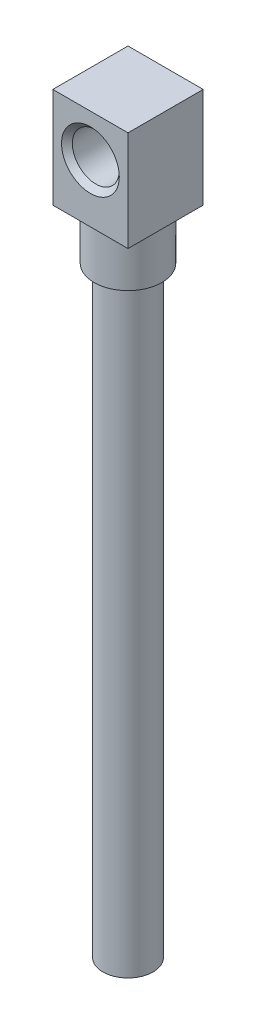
ISO-10303-21;
HEADER;
FILE_DESCRIPTION(('STEP AP214'),'2;1');
FILE_NAME('part.step','',(''),(''),'','','');
FILE_SCHEMA(('AUTOMOTIVE_DESIGN { 1 0 10303 214 1 1 1 1 }'));
ENDSEC;
DATA;
#1=APPLICATION_CONTEXT('core data for automotive mechanical design processes');
#2=APPLICATION_PROTOCOL_DEFINITION('international standard','automotive_design',2000,#1);
#3=PRODUCT_CONTEXT('',#1,'mechanical');
#4=PRODUCT('Part','Part','',(#3));
#5=PRODUCT_RELATED_PRODUCT_CATEGORY('part','',(#4));
#6=PRODUCT_DEFINITION_FORMATION('','',#4);
#7=PRODUCT_DEFINITION_CONTEXT('part definition',#1,'design');
#8=PRODUCT_DEFINITION('design','',#6,#7);
#9=PRODUCT_DEFINITION_SHAPE('','',#8);
#10=(LENGTH_UNIT() NAMED_UNIT(*) SI_UNIT(.MILLI.,.METRE.));
#11=(NAMED_UNIT(*) PLANE_ANGLE_UNIT() SI_UNIT($,.RADIAN.));
#12=(NAMED_UNIT(*) SI_UNIT($,.STERADIAN.) SOLID_ANGLE_UNIT());
#13=UNCERTAINTY_MEASURE_WITH_UNIT(LENGTH_MEASURE(1.E-05),#10,'distance_accuracy_value','');
#14=(GEOMETRIC_REPRESENTATION_CONTEXT(3) GLOBAL_UNCERTAINTY_ASSIGNED_CONTEXT((#13)) GLOBAL_UNIT_ASSIGNED_CONTEXT((#10,
#11,#12)) REPRESENTATION_CONTEXT('',''));
#15=CARTESIAN_POINT('',(0.,0.,0.));
#16=DIRECTION('',(0.,0.,1.));
#17=DIRECTION('',(1.,0.,0.));
#18=AXIS2_PLACEMENT_3D('',#15,#16,#17);
#19=CARTESIAN_POINT('',(-9.525,25.4,-9.525));
#20=DIRECTION('',(1.,0.,0.));
#21=DIRECTION('',(0.,0.,-1.));
#22=AXIS2_PLACEMENT_3D('',#19,#20,#21);
#23=PLANE('',#22);
#24=DIRECTION('',(0.,0.,1.));
#25=VECTOR('',#24,1.);
#26=CARTESIAN_POINT('',(-9.525,0.,-9.525));
#27=LINE('',#26,#25);
#28=CARTESIAN_POINT('',(-9.525,0.,-9.525));
#29=VERTEX_POINT('',#28);
#30=CARTESIAN_POINT('',(-9.525,0.,9.525));
#31=VERTEX_POINT('',#30);
#32=EDGE_CURVE('E104',#29,#31,#27,.T.);
#33=ORIENTED_EDGE('',*,*,#32,.T.);
#34=DIRECTION('',(0.,-1.,0.));
#35=VECTOR('',#34,1.);
#36=CARTESIAN_POINT('',(-9.525,25.4,9.525));
#37=LINE('',#36,#35);
#38=CARTESIAN_POINT('',(-9.525,25.4,9.525));
#39=VERTEX_POINT('',#38);
#40=EDGE_CURVE('E40',#39,#31,#37,.T.);
#41=ORIENTED_EDGE('',*,*,#40,.F.);
#42=DIRECTION('',(0.,0.,1.));
#43=VECTOR('',#42,1.);
#44=CARTESIAN_POINT('',(-9.525,25.4,-9.525));
#45=LINE('',#44,#43);
#46=CARTESIAN_POINT('',(-9.525,25.4,-9.525));
#47=VERTEX_POINT('',#46);
#48=EDGE_CURVE('E91',#47,#39,#45,.T.);
#49=ORIENTED_EDGE('',*,*,#48,.F.);
#50=DIRECTION('',(0.,-1.,0.));
#51=VECTOR('',#50,1.);
#52=CARTESIAN_POINT('',(-9.525,25.4,-9.525));
#53=LINE('',#52,#51);
#54=EDGE_CURVE('E100',#47,#29,#53,.T.);
#55=ORIENTED_EDGE('',*,*,#54,.T.);
#56=EDGE_LOOP('',(#33,#41,#49,#55));
#57=FACE_BOUND('',#56,.T.);
#58=ADVANCED_FACE('F37',(#57),#23,.F.);
#59=CARTESIAN_POINT('',(-9.525,25.4,9.525));
#60=DIRECTION('',(0.,0.,-1.));
#61=DIRECTION('',(-1.,0.,0.));
#62=AXIS2_PLACEMENT_3D('',#59,#60,#61);
#63=PLANE('',#62);
#64=CARTESIAN_POINT('',(0.,14.6540223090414,9.525));
#65=DIRECTION('',(0.,0.,1.));
#66=DIRECTION('',(1.,0.,0.));
#67=AXIS2_PLACEMENT_3D('',#64,#65,#66);
#68=CIRCLE('',#67,7.3152);
#69=CARTESIAN_POINT('',(7.3152,14.6540223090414,9.525));
#70=VERTEX_POINT('',#69);
#71=EDGE_CURVE('E131',#70,#70,#68,.T.);
#72=ORIENTED_EDGE('',*,*,#71,.F.);
#73=EDGE_LOOP('',(#72));
#74=FACE_BOUND('',#73,.T.);
#75=DIRECTION('',(1.,0.,0.));
#76=VECTOR('',#75,1.);
#77=CARTESIAN_POINT('',(-9.525,0.,9.525));
#78=LINE('',#77,#76);
#79=CARTESIAN_POINT('',(9.525,0.,9.525));
#80=VERTEX_POINT('',#79);
#81=EDGE_CURVE('E96',#31,#80,#78,.T.);
#82=ORIENTED_EDGE('',*,*,#81,.T.);
#83=DIRECTION('',(0.,-1.,0.));
#84=VECTOR('',#83,1.);
#85=CARTESIAN_POINT('',(9.525,25.4,9.525));
#86=LINE('',#85,#84);
#87=CARTESIAN_POINT('',(9.525,25.4,9.525));
#88=VERTEX_POINT('',#87);
#89=EDGE_CURVE('E94',#88,#80,#86,.T.);
#90=ORIENTED_EDGE('',*,*,#89,.F.);
#91=DIRECTION('',(1.,0.,0.));
#92=VECTOR('',#91,1.);
#93=CARTESIAN_POINT('',(-9.525,25.4,9.525));
#94=LINE('',#93,#92);
#95=EDGE_CURVE('E86',#39,#88,#94,.T.);
#96=ORIENTED_EDGE('',*,*,#95,.F.);
#97=ORIENTED_EDGE('',*,*,#40,.T.);
#98=EDGE_LOOP('',(#82,#90,#96,#97));
#99=FACE_BOUND('',#98,.T.);
#100=ADVANCED_FACE('F95',(#74,#99),#63,.F.);
#101=CARTESIAN_POINT('',(9.525,25.4,-9.525));
#102=DIRECTION('',(-1.,0.,0.));
#103=DIRECTION('',(0.,0.,1.));
#104=AXIS2_PLACEMENT_3D('',#101,#102,#103);
#105=PLANE('',#104);
#106=DIRECTION('',(0.,0.,-1.));
#107=VECTOR('',#106,1.);
#108=CARTESIAN_POINT('',(9.525,0.,-9.525));
#109=LINE('',#108,#107);
#110=CARTESIAN_POINT('',(9.525,0.,-9.525));
#111=VERTEX_POINT('',#110);
#112=EDGE_CURVE('E72',#80,#111,#109,.T.);
#113=ORIENTED_EDGE('',*,*,#112,.T.);
#114=DIRECTION('',(0.,-1.,0.));
#115=VECTOR('',#114,1.);
#116=CARTESIAN_POINT('',(9.525,25.4,-9.525));
#117=LINE('',#116,#115);
#118=CARTESIAN_POINT('',(9.525,25.4,-9.525));
#119=VERTEX_POINT('',#118);
#120=EDGE_CURVE('E97',#119,#111,#117,.T.);
#121=ORIENTED_EDGE('',*,*,#120,.F.);
#122=DIRECTION('',(0.,0.,-1.));
#123=VECTOR('',#122,1.);
#124=CARTESIAN_POINT('',(9.525,25.4,-9.525));
#125=LINE('',#124,#123);
#126=EDGE_CURVE('E89',#88,#119,#125,.T.);
#127=ORIENTED_EDGE('',*,*,#126,.F.);
#128=ORIENTED_EDGE('',*,*,#89,.T.);
#129=EDGE_LOOP('',(#113,#121,#127,#128));
#130=FACE_BOUND('',#129,.T.);
#131=ADVANCED_FACE('F98',(#130),#105,.F.);
#132=CARTESIAN_POINT('',(-9.525,25.4,-9.525));
#133=DIRECTION('',(0.,0.,1.));
#134=DIRECTION('',(1.,0.,0.));
#135=AXIS2_PLACEMENT_3D('',#132,#133,#134);
#136=PLANE('',#135);
#137=CARTESIAN_POINT('',(0.,14.6540223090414,-9.525));
#138=DIRECTION('',(0.,0.,1.));
#139=DIRECTION('',(1.,0.,0.));
#140=AXIS2_PLACEMENT_3D('',#137,#138,#139);
#141=CIRCLE('',#140,5.9436);
#142=CARTESIAN_POINT('',(5.9436,14.6540223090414,-9.525));
#143=VERTEX_POINT('',#142);
#144=EDGE_CURVE('E125',#143,#143,#141,.T.);
#145=ORIENTED_EDGE('',*,*,#144,.T.);
#146=EDGE_LOOP('',(#145));
#147=FACE_BOUND('',#146,.T.);
#148=DIRECTION('',(-1.,0.,0.));
#149=VECTOR('',#148,1.);
#150=CARTESIAN_POINT('',(-9.525,0.,-9.525));
#151=LINE('',#150,#149);
#152=EDGE_CURVE('E78',#111,#29,#151,.T.);
#153=ORIENTED_EDGE('',*,*,#152,.T.);
#154=ORIENTED_EDGE('',*,*,#54,.F.);
#155=DIRECTION('',(-1.,0.,0.));
#156=VECTOR('',#155,1.);
#157=CARTESIAN_POINT('',(-9.525,25.4,-9.525));
#158=LINE('',#157,#156);
#159=EDGE_CURVE('E55',#119,#47,#158,.T.);
#160=ORIENTED_EDGE('',*,*,#159,.F.);
#161=ORIENTED_EDGE('',*,*,#120,.T.);
#162=EDGE_LOOP('',(#153,#154,#160,#161));
#163=FACE_BOUND('',#162,.T.);
#164=ADVANCED_FACE('F112',(#147,#163),#136,.F.);
#165=CARTESIAN_POINT('',(0.,25.4,0.));
#166=DIRECTION('',(0.,1.,0.));
#167=DIRECTION('',(0.,0.,1.));
#168=AXIS2_PLACEMENT_3D('',#165,#166,#167);
#169=PLANE('',#168);
#170=ORIENTED_EDGE('',*,*,#48,.T.);
#171=ORIENTED_EDGE('',*,*,#95,.T.);
#172=ORIENTED_EDGE('',*,*,#126,.T.);
#173=ORIENTED_EDGE('',*,*,#159,.T.);
#174=EDGE_LOOP('',(#170,#171,#172,#173));
#175=FACE_BOUND('',#174,.T.);
#176=ADVANCED_FACE('F87',(#175),#169,.T.);
#177=CARTESIAN_POINT('',(0.,0.,0.));
#178=DIRECTION('',(0.,1.,0.));
#179=DIRECTION('',(0.,0.,1.));
#180=AXIS2_PLACEMENT_3D('',#177,#178,#179);
#181=PLANE('',#180);
#182=CARTESIAN_POINT('',(0.,0.,0.));
#183=DIRECTION('',(0.,-1.,0.));
#184=DIRECTION('',(0.,0.,-1.));
#185=AXIS2_PLACEMENT_3D('',#182,#183,#184);
#186=CIRCLE('',#185,8.5725);
#187=CARTESIAN_POINT('',(0.,0.,-8.5725));
#188=VERTEX_POINT('',#187);
#189=EDGE_CURVE('E46',#188,#188,#186,.T.);
#190=ORIENTED_EDGE('',*,*,#189,.F.);
#191=EDGE_LOOP('',(#190));
#192=FACE_BOUND('',#191,.T.);
#193=ORIENTED_EDGE('',*,*,#32,.F.);
#194=ORIENTED_EDGE('',*,*,#152,.F.);
#195=ORIENTED_EDGE('',*,*,#112,.F.);
#196=ORIENTED_EDGE('',*,*,#81,.F.);
#197=EDGE_LOOP('',(#193,#194,#195,#196));
#198=FACE_BOUND('',#197,.T.);
#199=ADVANCED_FACE('F115',(#192,#198),#181,.F.);
#200=CARTESIAN_POINT('',(0.,-12.7,0.));
#201=DIRECTION('',(0.,1.,0.));
#202=DIRECTION('',(0.,0.,1.));
#203=AXIS2_PLACEMENT_3D('',#200,#201,#202);
#204=CYLINDRICAL_SURFACE('',#203,8.5725);
#205=CARTESIAN_POINT('',(0.,-12.7,0.));
#206=DIRECTION('',(0.,-1.,0.));
#207=DIRECTION('',(0.,0.,-1.));
#208=AXIS2_PLACEMENT_3D('',#205,#206,#207);
#209=CIRCLE('',#208,8.5725);
#210=CARTESIAN_POINT('',(0.,-12.7,-8.5725));
#211=VERTEX_POINT('',#210);
#212=EDGE_CURVE('E107',#211,#211,#209,.T.);
#213=ORIENTED_EDGE('',*,*,#212,.F.);
#214=EDGE_LOOP('',(#213));
#215=FACE_BOUND('',#214,.T.);
#216=ORIENTED_EDGE('',*,*,#189,.T.);
#217=EDGE_LOOP('',(#216));
#218=FACE_BOUND('',#217,.T.);
#219=ADVANCED_FACE('F149',(#215,#218),#204,.T.);
#220=CARTESIAN_POINT('',(0.,-12.7,0.));
#221=DIRECTION('',(0.,-1.,0.));
#222=DIRECTION('',(0.,0.,-1.));
#223=AXIS2_PLACEMENT_3D('',#220,#221,#222);
#224=PLANE('',#223);
#225=CARTESIAN_POINT('',(0.,-12.7,0.));
#226=DIRECTION('',(0.,-1.,0.));
#227=DIRECTION('',(0.,0.,-1.));
#228=AXIS2_PLACEMENT_3D('',#225,#226,#227);
#229=CIRCLE('',#228,6.35);
#230=CARTESIAN_POINT('',(0.,-12.7,6.35));
#231=VERTEX_POINT('',#230);
#232=EDGE_CURVE('E11',#231,#231,#229,.T.);
#233=ORIENTED_EDGE('',*,*,#232,.F.);
#234=EDGE_LOOP('',(#233));
#235=FACE_BOUND('',#234,.T.);
#236=ORIENTED_EDGE('',*,*,#212,.T.);
#237=EDGE_LOOP('',(#236));
#238=FACE_BOUND('',#237,.T.);
#239=ADVANCED_FACE('F155',(#235,#238),#224,.T.);
#240=CARTESIAN_POINT('',(0.,-165.1,0.));
#241=DIRECTION('',(0.,1.,0.));
#242=DIRECTION('',(0.,0.,1.));
#243=AXIS2_PLACEMENT_3D('',#240,#241,#242);
#244=CYLINDRICAL_SURFACE('',#243,6.35);
#245=CARTESIAN_POINT('',(0.,-165.1,0.));
#246=DIRECTION('',(0.,-1.,0.));
#247=DIRECTION('',(0.,0.,-1.));
#248=AXIS2_PLACEMENT_3D('',#245,#246,#247);
#249=CIRCLE('',#248,6.35);
#250=CARTESIAN_POINT('',(0.,-165.1,6.35));
#251=VERTEX_POINT('',#250);
#252=EDGE_CURVE('E121',#251,#251,#249,.T.);
#253=CARTESIAN_POINT('',(0.,-165.1,6.35));
#254=CARTESIAN_POINT('',(0.,-163.5125,6.35));
#255=CARTESIAN_POINT('',(0.,-161.925,6.35));
#256=CARTESIAN_POINT('',(0.,-158.75,6.35));
#257=CARTESIAN_POINT('',(0.,-157.1625,6.35));
#258=CARTESIAN_POINT('',(0.,-153.9875,6.35));
#259=CARTESIAN_POINT('',(0.,-152.4,6.35));
#260=CARTESIAN_POINT('',(0.,-149.225,6.35));
#261=CARTESIAN_POINT('',(0.,-147.6375,6.35));
#262=CARTESIAN_POINT('',(0.,-144.4625,6.35));
#263=CARTESIAN_POINT('',(0.,-142.875,6.35));
#264=CARTESIAN_POINT('',(0.,-139.7,6.35));
#265=CARTESIAN_POINT('',(0.,-138.1125,6.35));
#266=CARTESIAN_POINT('',(0.,-134.9375,6.35));
#267=CARTESIAN_POINT('',(0.,-133.35,6.35));
#268=CARTESIAN_POINT('',(0.,-130.175,6.35));
#269=CARTESIAN_POINT('',(0.,-128.5875,6.35));
#270=CARTESIAN_POINT('',(0.,-125.4125,6.35));
#271=CARTESIAN_POINT('',(0.,-123.825,6.35));
#272=CARTESIAN_POINT('',(0.,-120.65,6.35));
#273=CARTESIAN_POINT('',(0.,-119.0625,6.35));
#274=CARTESIAN_POINT('',(0.,-115.8875,6.35));
#275=CARTESIAN_POINT('',(0.,-114.3,6.35));
#276=CARTESIAN_POINT('',(0.,-111.125,6.35));
#277=CARTESIAN_POINT('',(0.,-109.5375,6.35));
#278=CARTESIAN_POINT('',(0.,-106.3625,6.35));
#279=CARTESIAN_POINT('',(0.,-104.775,6.35));
#280=CARTESIAN_POINT('',(0.,-101.6,6.35));
#281=CARTESIAN_POINT('',(0.,-100.0125,6.35));
#282=CARTESIAN_POINT('',(0.,-96.8375,6.35));
#283=CARTESIAN_POINT('',(0.,-95.25,6.35));
#284=CARTESIAN_POINT('',(0.,-92.075,6.35));
#285=CARTESIAN_POINT('',(0.,-90.4875,6.35));
#286=CARTESIAN_POINT('',(0.,-87.3125,6.35));
#287=CARTESIAN_POINT('',(0.,-85.725,6.35));
#288=CARTESIAN_POINT('',(0.,-82.55,6.35));
#289=CARTESIAN_POINT('',(0.,-80.9625,6.35));
#290=CARTESIAN_POINT('',(0.,-77.7875,6.35));
#291=CARTESIAN_POINT('',(0.,-76.2,6.35));
#292=CARTESIAN_POINT('',(0.,-73.025,6.35));
#293=CARTESIAN_POINT('',(0.,-71.4375,6.35));
#294=CARTESIAN_POINT('',(0.,-68.2625,6.35));
#295=CARTESIAN_POINT('',(0.,-66.675,6.35));
#296=CARTESIAN_POINT('',(0.,-63.5,6.35));
#297=CARTESIAN_POINT('',(0.,-61.9125,6.35));
#298=CARTESIAN_POINT('',(0.,-58.7375,6.35));
#299=CARTESIAN_POINT('',(0.,-57.15,6.35));
#300=CARTESIAN_POINT('',(0.,-53.975,6.35));
#301=CARTESIAN_POINT('',(0.,-52.3875,6.35));
#302=CARTESIAN_POINT('',(0.,-49.2125,6.35));
#303=CARTESIAN_POINT('',(0.,-47.625,6.35));
#304=CARTESIAN_POINT('',(0.,-44.45,6.35));
#305=CARTESIAN_POINT('',(0.,-42.8625,6.35));
#306=CARTESIAN_POINT('',(0.,-39.6875,6.35));
#307=CARTESIAN_POINT('',(0.,-38.1,6.35));
#308=CARTESIAN_POINT('',(0.,-34.925,6.35));
#309=CARTESIAN_POINT('',(0.,-33.3375,6.35));
#310=CARTESIAN_POINT('',(0.,-30.1625,6.35));
#311=CARTESIAN_POINT('',(0.,-28.575,6.35));
#312=CARTESIAN_POINT('',(0.,-25.4,6.35));
#313=CARTESIAN_POINT('',(0.,-23.8125,6.35));
#314=CARTESIAN_POINT('',(0.,-20.6375,6.35));
#315=CARTESIAN_POINT('',(0.,-19.05,6.35));
#316=CARTESIAN_POINT('',(0.,-15.875,6.35));
#317=CARTESIAN_POINT('',(0.,-14.2875,6.35));
#318=CARTESIAN_POINT('',(0.,-12.7,6.35));
#319=B_SPLINE_CURVE_WITH_KNOTS('',3,(#253,#254,#255,#256,#257,#258,#259,#260,#261,#262,#263,
#264,#265,#266,#267,#268,#269,#270,#271,#272,#273,#274,#275,#276,#277,#278,#279,#280,#281,#282,
#283,#284,#285,#286,#287,#288,#289,#290,#291,#292,#293,#294,#295,#296,#297,#298,#299,#300,#301,
#302,#303,#304,#305,#306,#307,#308,#309,#310,#311,#312,#313,#314,#315,#316,#317,#318),
.UNSPECIFIED.,.F.,.F.,(4,2,2,2,2,2,2,2,2,2,2,2,2,2,2,2,2,2,2,2,2,2,2,2,2,2,2,2,2,2,2,2,4),(0.,
4.7625,9.52500000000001,14.2875,19.05,23.8125,28.575,33.3375,38.1,42.8625,47.625,52.3875,57.15,
61.9125,66.675,71.4375,76.2,80.9625,85.725,90.4875,95.25,100.0125,104.775,109.5375,114.3,
119.0625,123.825,128.5875,133.35,138.1125,142.875,147.6375,152.4),.UNSPECIFIED.);
#320=EDGE_CURVE('BSEAM159',#251,#231,#319,.T.);
#321=ORIENTED_EDGE('',*,*,#252,.F.);
#322=ORIENTED_EDGE('',*,*,#232,.T.);
#323=ORIENTED_EDGE('',*,*,#320,.T.);
#324=ORIENTED_EDGE('',*,*,#320,.F.);
#325=EDGE_LOOP('',(#321,#323,#322,#324));
#326=FACE_BOUND('',#325,.T.);
#327=ADVANCED_FACE('F159',(#326),#244,.T.);
#328=CARTESIAN_POINT('',(0.,-165.1,0.));
#329=DIRECTION('',(0.,-1.,0.));
#330=DIRECTION('',(0.,0.,-1.));
#331=AXIS2_PLACEMENT_3D('',#328,#329,#330);
#332=PLANE('',#331);
#333=ORIENTED_EDGE('',*,*,#252,.T.);
#334=EDGE_LOOP('',(#333));
#335=FACE_BOUND('',#334,.T.);
#336=ADVANCED_FACE('F163',(#335),#332,.T.);
#337=CARTESIAN_POINT('',(0.,14.6540223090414,9.525));
#338=DIRECTION('',(0.,0.,1.));
#339=DIRECTION('',(1.,0.,0.));
#340=AXIS2_PLACEMENT_3D('',#337,#338,#339);
#341=CYLINDRICAL_SURFACE('',#340,5.9436);
#342=ORIENTED_EDGE('',*,*,#144,.F.);
#343=EDGE_LOOP('',(#342));
#344=FACE_BOUND('',#343,.T.);
#345=CARTESIAN_POINT('',(0.,14.6540223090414,8.1534));
#346=DIRECTION('',(0.,0.,1.));
#347=DIRECTION('',(1.,0.,0.));
#348=AXIS2_PLACEMENT_3D('',#345,#346,#347);
#349=CIRCLE('',#348,5.9436);
#350=CARTESIAN_POINT('',(5.9436,14.6540223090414,8.1534));
#351=VERTEX_POINT('',#350);
#352=EDGE_CURVE('E128',#351,#351,#349,.T.);
#353=ORIENTED_EDGE('',*,*,#352,.T.);
#354=EDGE_LOOP('',(#353));
#355=FACE_BOUND('',#354,.T.);
#356=ADVANCED_FACE('F167',(#344,#355),#341,.F.);
#357=CARTESIAN_POINT('',(0.,14.6540223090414,9.525));
#358=DIRECTION('',(0.,0.,1.));
#359=DIRECTION('',(1.,0.,0.));
#360=AXIS2_PLACEMENT_3D('',#357,#358,#359);
#361=CONICAL_SURFACE('',#360,7.3152,0.785398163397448);
#362=ORIENTED_EDGE('',*,*,#352,.F.);
#363=EDGE_LOOP('',(#362));
#364=FACE_BOUND('',#363,.T.);
#365=ORIENTED_EDGE('',*,*,#71,.T.);
#366=EDGE_LOOP('',(#365));
#367=FACE_BOUND('',#366,.T.);
#368=ADVANCED_FACE('F135',(#364,#367),#361,.F.);
#369=CLOSED_SHELL('',(#58,#100,#131,#164,#176,#199,#219,#239,#327,#336,#356,#368));
#370=MANIFOLD_SOLID_BREP('B2',#369);
#371=ADVANCED_BREP_SHAPE_REPRESENTATION('',(#18,#370),#14);
#372=SHAPE_DEFINITION_REPRESENTATION(#9,#371);
ENDSEC;
END-ISO-10303-21;
